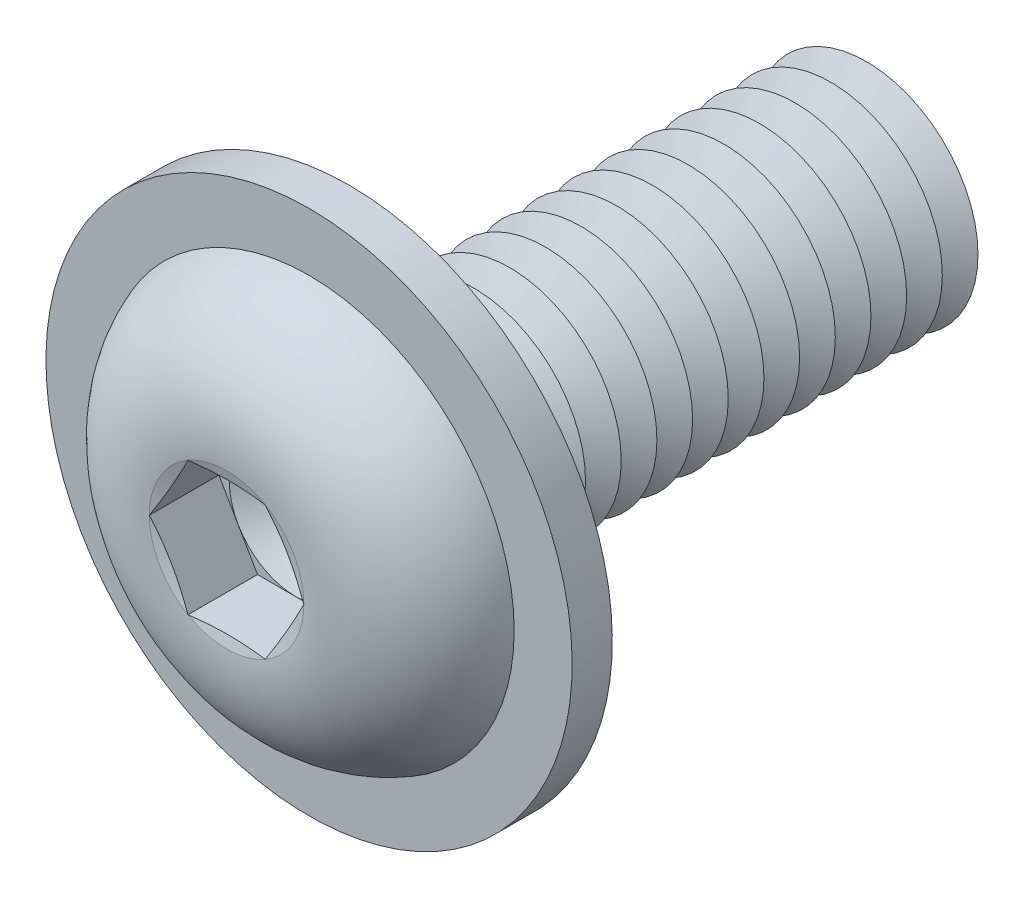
ISO-10303-21;
HEADER;
FILE_DESCRIPTION(('STEP AP214'),'2;1');
FILE_NAME('part.step','',(''),(''),'','','');
FILE_SCHEMA(('AUTOMOTIVE_DESIGN { 1 0 10303 214 1 1 1 1 }'));
ENDSEC;
DATA;
#1=APPLICATION_CONTEXT('core data for automotive mechanical design processes');
#2=APPLICATION_PROTOCOL_DEFINITION('international standard','automotive_design',2000,#1);
#3=PRODUCT_CONTEXT('',#1,'mechanical');
#4=PRODUCT('Part','Part','',(#3));
#5=PRODUCT_RELATED_PRODUCT_CATEGORY('part','',(#4));
#6=PRODUCT_DEFINITION_FORMATION('','',#4);
#7=PRODUCT_DEFINITION_CONTEXT('part definition',#1,'design');
#8=PRODUCT_DEFINITION('design','',#6,#7);
#9=PRODUCT_DEFINITION_SHAPE('','',#8);
#10=(LENGTH_UNIT() NAMED_UNIT(*) SI_UNIT(.MILLI.,.METRE.));
#11=(NAMED_UNIT(*) PLANE_ANGLE_UNIT() SI_UNIT($,.RADIAN.));
#12=(NAMED_UNIT(*) SI_UNIT($,.STERADIAN.) SOLID_ANGLE_UNIT());
#13=UNCERTAINTY_MEASURE_WITH_UNIT(LENGTH_MEASURE(1.E-05),#10,'distance_accuracy_value','');
#14=(GEOMETRIC_REPRESENTATION_CONTEXT(3) GLOBAL_UNCERTAINTY_ASSIGNED_CONTEXT((#13)) GLOBAL_UNIT_ASSIGNED_CONTEXT((#10,
#11,#12)) REPRESENTATION_CONTEXT('',''));
#15=CARTESIAN_POINT('',(0.,0.,0.));
#16=DIRECTION('',(0.,0.,1.));
#17=DIRECTION('',(1.,0.,0.));
#18=AXIS2_PLACEMENT_3D('',#15,#16,#17);
#19=CARTESIAN_POINT('',(0.,0.,-9.2));
#20=DIRECTION('',(0.,0.,1.));
#21=DIRECTION('',(1.,0.,0.));
#22=AXIS2_PLACEMENT_3D('',#19,#20,#21);
#23=CONICAL_SURFACE('',#22,2.50000000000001,1.0471975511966);
#24=CARTESIAN_POINT('',(0.,0.,-9.6));
#25=DIRECTION('',(0.,0.,1.));
#26=DIRECTION('',(1.,0.,0.));
#27=AXIS2_PLACEMENT_3D('',#24,#25,#26);
#28=CIRCLE('',#27,1.80717967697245);
#29=CARTESIAN_POINT('',(1.80717967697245,0.,-9.6));
#30=VERTEX_POINT('',#29);
#31=EDGE_CURVE('E330',#30,#30,#28,.T.);
#32=ORIENTED_EDGE('',*,*,#31,.T.);
#33=EDGE_LOOP('',(#32));
#34=FACE_BOUND('',#33,.T.);
#35=CARTESIAN_POINT('',(0.,0.,-9.2));
#36=DIRECTION('',(0.,0.,1.));
#37=DIRECTION('',(1.,0.,0.));
#38=AXIS2_PLACEMENT_3D('',#35,#36,#37);
#39=CIRCLE('',#38,2.50000000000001);
#40=CARTESIAN_POINT('',(2.50000000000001,0.,-9.2));
#41=VERTEX_POINT('',#40);
#42=EDGE_CURVE('E326',#41,#41,#39,.T.);
#43=ORIENTED_EDGE('',*,*,#42,.F.);
#44=EDGE_LOOP('',(#43));
#45=FACE_BOUND('',#44,.T.);
#46=ADVANCED_FACE('F39',(#34,#45),#23,.T.);
#47=CARTESIAN_POINT('',(0.,0.,-9.6));
#48=DIRECTION('',(0.,0.,-1.));
#49=DIRECTION('',(-1.,0.,0.));
#50=AXIS2_PLACEMENT_3D('',#47,#48,#49);
#51=CONICAL_SURFACE('',#50,1.80717967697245,1.0471975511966);
#52=CARTESIAN_POINT('',(0.,0.,-10.));
#53=DIRECTION('',(0.,0.,1.));
#54=DIRECTION('',(1.,0.,0.));
#55=AXIS2_PLACEMENT_3D('',#52,#53,#54);
#56=CIRCLE('',#55,2.50000000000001);
#57=CARTESIAN_POINT('',(2.50000000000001,0.,-10.));
#58=VERTEX_POINT('',#57);
#59=EDGE_CURVE('E334',#58,#58,#56,.T.);
#60=ORIENTED_EDGE('',*,*,#59,.T.);
#61=EDGE_LOOP('',(#60));
#62=FACE_BOUND('',#61,.T.);
#63=ORIENTED_EDGE('',*,*,#31,.F.);
#64=EDGE_LOOP('',(#63));
#65=FACE_BOUND('',#64,.T.);
#66=ADVANCED_FACE('F463',(#62,#65),#51,.T.);
#67=CARTESIAN_POINT('',(0.,2.50000000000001,-12.));
#68=DIRECTION('',(0.,0.,-1.));
#69=DIRECTION('',(-1.,0.,0.));
#70=AXIS2_PLACEMENT_3D('',#67,#68,#69);
#71=PLANE('',#70);
#72=CARTESIAN_POINT('',(0.,0.,-12.));
#73=DIRECTION('',(0.,0.,1.));
#74=DIRECTION('',(1.,0.,0.));
#75=AXIS2_PLACEMENT_3D('',#72,#73,#74);
#76=CIRCLE('',#75,1.80717967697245);
#77=CARTESIAN_POINT('',(1.80717967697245,0.,-12.));
#78=VERTEX_POINT('',#77);
#79=EDGE_CURVE('E354',#78,#78,#76,.T.);
#80=ORIENTED_EDGE('',*,*,#79,.F.);
#81=EDGE_LOOP('',(#80));
#82=FACE_BOUND('',#81,.T.);
#83=ADVANCED_FACE('F469',(#82),#71,.T.);
#84=CARTESIAN_POINT('',(0.,0.,-11.6));
#85=DIRECTION('',(0.,0.,1.));
#86=DIRECTION('',(1.,0.,0.));
#87=AXIS2_PLACEMENT_3D('',#84,#85,#86);
#88=CONICAL_SURFACE('',#87,2.50000000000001,1.0471975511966);
#89=ORIENTED_EDGE('',*,*,#79,.T.);
#90=EDGE_LOOP('',(#89));
#91=FACE_BOUND('',#90,.T.);
#92=CARTESIAN_POINT('',(0.,0.,-11.6));
#93=DIRECTION('',(0.,0.,1.));
#94=DIRECTION('',(1.,0.,0.));
#95=AXIS2_PLACEMENT_3D('',#92,#93,#94);
#96=CIRCLE('',#95,2.50000000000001);
#97=CARTESIAN_POINT('',(2.50000000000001,0.,-11.6));
#98=VERTEX_POINT('',#97);
#99=EDGE_CURVE('E350',#98,#98,#96,.T.);
#100=ORIENTED_EDGE('',*,*,#99,.F.);
#101=EDGE_LOOP('',(#100));
#102=FACE_BOUND('',#101,.T.);
#103=ADVANCED_FACE('F488',(#91,#102),#88,.T.);
#104=CARTESIAN_POINT('',(0.,0.,-11.2));
#105=DIRECTION('',(0.,0.,-1.));
#106=DIRECTION('',(-1.,0.,0.));
#107=AXIS2_PLACEMENT_3D('',#104,#105,#106);
#108=CONICAL_SURFACE('',#107,1.80717967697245,1.0471975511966);
#109=ORIENTED_EDGE('',*,*,#99,.T.);
#110=EDGE_LOOP('',(#109));
#111=FACE_BOUND('',#110,.T.);
#112=CARTESIAN_POINT('',(0.,0.,-11.2));
#113=DIRECTION('',(0.,0.,1.));
#114=DIRECTION('',(1.,0.,0.));
#115=AXIS2_PLACEMENT_3D('',#112,#113,#114);
#116=CIRCLE('',#115,1.80717967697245);
#117=CARTESIAN_POINT('',(1.80717967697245,0.,-11.2));
#118=VERTEX_POINT('',#117);
#119=EDGE_CURVE('E346',#118,#118,#116,.T.);
#120=ORIENTED_EDGE('',*,*,#119,.F.);
#121=EDGE_LOOP('',(#120));
#122=FACE_BOUND('',#121,.T.);
#123=ADVANCED_FACE('F485',(#111,#122),#108,.T.);
#124=CARTESIAN_POINT('',(0.,0.,-10.8));
#125=DIRECTION('',(0.,0.,1.));
#126=DIRECTION('',(1.,0.,0.));
#127=AXIS2_PLACEMENT_3D('',#124,#125,#126);
#128=CONICAL_SURFACE('',#127,2.50000000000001,1.0471975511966);
#129=ORIENTED_EDGE('',*,*,#119,.T.);
#130=EDGE_LOOP('',(#129));
#131=FACE_BOUND('',#130,.T.);
#132=CARTESIAN_POINT('',(0.,0.,-10.8));
#133=DIRECTION('',(0.,0.,1.));
#134=DIRECTION('',(1.,0.,0.));
#135=AXIS2_PLACEMENT_3D('',#132,#133,#134);
#136=CIRCLE('',#135,2.50000000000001);
#137=CARTESIAN_POINT('',(2.50000000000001,0.,-10.8));
#138=VERTEX_POINT('',#137);
#139=EDGE_CURVE('E342',#138,#138,#136,.T.);
#140=ORIENTED_EDGE('',*,*,#139,.F.);
#141=EDGE_LOOP('',(#140));
#142=FACE_BOUND('',#141,.T.);
#143=ADVANCED_FACE('F479',(#131,#142),#128,.T.);
#144=CARTESIAN_POINT('',(0.,0.,-10.4));
#145=DIRECTION('',(0.,0.,-1.));
#146=DIRECTION('',(-1.,0.,0.));
#147=AXIS2_PLACEMENT_3D('',#144,#145,#146);
#148=CONICAL_SURFACE('',#147,1.80717967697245,1.0471975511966);
#149=ORIENTED_EDGE('',*,*,#139,.T.);
#150=EDGE_LOOP('',(#149));
#151=FACE_BOUND('',#150,.T.);
#152=CARTESIAN_POINT('',(0.,0.,-10.4));
#153=DIRECTION('',(0.,0.,1.));
#154=DIRECTION('',(1.,0.,0.));
#155=AXIS2_PLACEMENT_3D('',#152,#153,#154);
#156=CIRCLE('',#155,1.80717967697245);
#157=CARTESIAN_POINT('',(1.80717967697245,0.,-10.4));
#158=VERTEX_POINT('',#157);
#159=EDGE_CURVE('E338',#158,#158,#156,.T.);
#160=ORIENTED_EDGE('',*,*,#159,.F.);
#161=EDGE_LOOP('',(#160));
#162=FACE_BOUND('',#161,.T.);
#163=ADVANCED_FACE('F475',(#151,#162),#148,.T.);
#164=CARTESIAN_POINT('',(0.,0.,-10.));
#165=DIRECTION('',(0.,0.,1.));
#166=DIRECTION('',(1.,0.,0.));
#167=AXIS2_PLACEMENT_3D('',#164,#165,#166);
#168=CONICAL_SURFACE('',#167,2.50000000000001,1.0471975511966);
#169=ORIENTED_EDGE('',*,*,#159,.T.);
#170=EDGE_LOOP('',(#169));
#171=FACE_BOUND('',#170,.T.);
#172=ORIENTED_EDGE('',*,*,#59,.F.);
#173=EDGE_LOOP('',(#172));
#174=FACE_BOUND('',#173,.T.);
#175=ADVANCED_FACE('F478',(#171,#174),#168,.T.);
#176=CARTESIAN_POINT('',(0.,0.,-8.4));
#177=DIRECTION('',(0.,0.,1.));
#178=DIRECTION('',(1.,0.,0.));
#179=AXIS2_PLACEMENT_3D('',#176,#177,#178);
#180=CONICAL_SURFACE('',#179,2.50000000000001,1.0471975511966);
#181=CARTESIAN_POINT('',(0.,0.,-8.8));
#182=DIRECTION('',(0.,0.,1.));
#183=DIRECTION('',(1.,0.,0.));
#184=AXIS2_PLACEMENT_3D('',#181,#182,#183);
#185=CIRCLE('',#184,1.80717967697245);
#186=CARTESIAN_POINT('',(1.80717967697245,0.,-8.8));
#187=VERTEX_POINT('',#186);
#188=EDGE_CURVE('E322',#187,#187,#185,.T.);
#189=ORIENTED_EDGE('',*,*,#188,.T.);
#190=EDGE_LOOP('',(#189));
#191=FACE_BOUND('',#190,.T.);
#192=CARTESIAN_POINT('',(0.,0.,-8.4));
#193=DIRECTION('',(0.,0.,1.));
#194=DIRECTION('',(1.,0.,0.));
#195=AXIS2_PLACEMENT_3D('',#192,#193,#194);
#196=CIRCLE('',#195,2.50000000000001);
#197=CARTESIAN_POINT('',(2.50000000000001,0.,-8.4));
#198=VERTEX_POINT('',#197);
#199=EDGE_CURVE('E318',#198,#198,#196,.T.);
#200=ORIENTED_EDGE('',*,*,#199,.F.);
#201=EDGE_LOOP('',(#200));
#202=FACE_BOUND('',#201,.T.);
#203=ADVANCED_FACE('F483',(#191,#202),#180,.T.);
#204=CARTESIAN_POINT('',(0.,0.,-8.8));
#205=DIRECTION('',(0.,0.,-1.));
#206=DIRECTION('',(-1.,0.,0.));
#207=AXIS2_PLACEMENT_3D('',#204,#205,#206);
#208=CONICAL_SURFACE('',#207,1.80717967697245,1.0471975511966);
#209=ORIENTED_EDGE('',*,*,#42,.T.);
#210=EDGE_LOOP('',(#209));
#211=FACE_BOUND('',#210,.T.);
#212=ORIENTED_EDGE('',*,*,#188,.F.);
#213=EDGE_LOOP('',(#212));
#214=FACE_BOUND('',#213,.T.);
#215=ADVANCED_FACE('F534',(#211,#214),#208,.T.);
#216=CARTESIAN_POINT('',(0.,0.,-7.6));
#217=DIRECTION('',(0.,0.,1.));
#218=DIRECTION('',(1.,0.,0.));
#219=AXIS2_PLACEMENT_3D('',#216,#217,#218);
#220=CONICAL_SURFACE('',#219,2.50000000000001,1.0471975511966);
#221=CARTESIAN_POINT('',(0.,0.,-8.));
#222=DIRECTION('',(0.,0.,1.));
#223=DIRECTION('',(1.,0.,0.));
#224=AXIS2_PLACEMENT_3D('',#221,#222,#223);
#225=CIRCLE('',#224,1.80717967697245);
#226=CARTESIAN_POINT('',(1.80717967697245,0.,-8.));
#227=VERTEX_POINT('',#226);
#228=EDGE_CURVE('E314',#227,#227,#225,.T.);
#229=ORIENTED_EDGE('',*,*,#228,.T.);
#230=EDGE_LOOP('',(#229));
#231=FACE_BOUND('',#230,.T.);
#232=CARTESIAN_POINT('',(0.,0.,-7.6));
#233=DIRECTION('',(0.,0.,1.));
#234=DIRECTION('',(1.,0.,0.));
#235=AXIS2_PLACEMENT_3D('',#232,#233,#234);
#236=CIRCLE('',#235,2.50000000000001);
#237=CARTESIAN_POINT('',(2.50000000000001,0.,-7.6));
#238=VERTEX_POINT('',#237);
#239=EDGE_CURVE('E310',#238,#238,#236,.T.);
#240=ORIENTED_EDGE('',*,*,#239,.F.);
#241=EDGE_LOOP('',(#240));
#242=FACE_BOUND('',#241,.T.);
#243=ADVANCED_FACE('F540',(#231,#242),#220,.T.);
#244=CARTESIAN_POINT('',(0.,0.,-8.));
#245=DIRECTION('',(0.,0.,-1.));
#246=DIRECTION('',(-1.,0.,0.));
#247=AXIS2_PLACEMENT_3D('',#244,#245,#246);
#248=CONICAL_SURFACE('',#247,1.80717967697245,1.0471975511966);
#249=ORIENTED_EDGE('',*,*,#199,.T.);
#250=EDGE_LOOP('',(#249));
#251=FACE_BOUND('',#250,.T.);
#252=ORIENTED_EDGE('',*,*,#228,.F.);
#253=EDGE_LOOP('',(#252));
#254=FACE_BOUND('',#253,.T.);
#255=ADVANCED_FACE('F547',(#251,#254),#248,.T.);
#256=CARTESIAN_POINT('',(0.,0.,-6.8));
#257=DIRECTION('',(0.,0.,1.));
#258=DIRECTION('',(1.,0.,0.));
#259=AXIS2_PLACEMENT_3D('',#256,#257,#258);
#260=CONICAL_SURFACE('',#259,2.50000000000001,1.0471975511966);
#261=CARTESIAN_POINT('',(0.,0.,-7.2));
#262=DIRECTION('',(0.,0.,1.));
#263=DIRECTION('',(1.,0.,0.));
#264=AXIS2_PLACEMENT_3D('',#261,#262,#263);
#265=CIRCLE('',#264,1.80717967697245);
#266=CARTESIAN_POINT('',(1.80717967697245,0.,-7.2));
#267=VERTEX_POINT('',#266);
#268=EDGE_CURVE('E306',#267,#267,#265,.T.);
#269=ORIENTED_EDGE('',*,*,#268,.T.);
#270=EDGE_LOOP('',(#269));
#271=FACE_BOUND('',#270,.T.);
#272=CARTESIAN_POINT('',(0.,0.,-6.8));
#273=DIRECTION('',(0.,0.,1.));
#274=DIRECTION('',(1.,0.,0.));
#275=AXIS2_PLACEMENT_3D('',#272,#273,#274);
#276=CIRCLE('',#275,2.50000000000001);
#277=CARTESIAN_POINT('',(2.50000000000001,0.,-6.8));
#278=VERTEX_POINT('',#277);
#279=EDGE_CURVE('E302',#278,#278,#276,.T.);
#280=ORIENTED_EDGE('',*,*,#279,.F.);
#281=EDGE_LOOP('',(#280));
#282=FACE_BOUND('',#281,.T.);
#283=ADVANCED_FACE('F554',(#271,#282),#260,.T.);
#284=CARTESIAN_POINT('',(0.,0.,-7.2));
#285=DIRECTION('',(0.,0.,-1.));
#286=DIRECTION('',(-1.,0.,0.));
#287=AXIS2_PLACEMENT_3D('',#284,#285,#286);
#288=CONICAL_SURFACE('',#287,1.80717967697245,1.0471975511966);
#289=ORIENTED_EDGE('',*,*,#239,.T.);
#290=EDGE_LOOP('',(#289));
#291=FACE_BOUND('',#290,.T.);
#292=ORIENTED_EDGE('',*,*,#268,.F.);
#293=EDGE_LOOP('',(#292));
#294=FACE_BOUND('',#293,.T.);
#295=ADVANCED_FACE('F561',(#291,#294),#288,.T.);
#296=CARTESIAN_POINT('',(0.,0.,-6.));
#297=DIRECTION('',(0.,0.,1.));
#298=DIRECTION('',(1.,0.,0.));
#299=AXIS2_PLACEMENT_3D('',#296,#297,#298);
#300=CONICAL_SURFACE('',#299,2.50000000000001,1.0471975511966);
#301=CARTESIAN_POINT('',(0.,0.,-6.4));
#302=DIRECTION('',(0.,0.,1.));
#303=DIRECTION('',(1.,0.,0.));
#304=AXIS2_PLACEMENT_3D('',#301,#302,#303);
#305=CIRCLE('',#304,1.80717967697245);
#306=CARTESIAN_POINT('',(1.80717967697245,0.,-6.4));
#307=VERTEX_POINT('',#306);
#308=EDGE_CURVE('E298',#307,#307,#305,.T.);
#309=ORIENTED_EDGE('',*,*,#308,.T.);
#310=EDGE_LOOP('',(#309));
#311=FACE_BOUND('',#310,.T.);
#312=CARTESIAN_POINT('',(0.,0.,-6.));
#313=DIRECTION('',(0.,0.,1.));
#314=DIRECTION('',(1.,0.,0.));
#315=AXIS2_PLACEMENT_3D('',#312,#313,#314);
#316=CIRCLE('',#315,2.50000000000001);
#317=CARTESIAN_POINT('',(2.50000000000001,0.,-6.));
#318=VERTEX_POINT('',#317);
#319=EDGE_CURVE('E294',#318,#318,#316,.T.);
#320=ORIENTED_EDGE('',*,*,#319,.F.);
#321=EDGE_LOOP('',(#320));
#322=FACE_BOUND('',#321,.T.);
#323=ADVANCED_FACE('F568',(#311,#322),#300,.T.);
#324=CARTESIAN_POINT('',(0.,0.,-6.4));
#325=DIRECTION('',(0.,0.,-1.));
#326=DIRECTION('',(-1.,0.,0.));
#327=AXIS2_PLACEMENT_3D('',#324,#325,#326);
#328=CONICAL_SURFACE('',#327,1.80717967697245,1.0471975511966);
#329=ORIENTED_EDGE('',*,*,#279,.T.);
#330=EDGE_LOOP('',(#329));
#331=FACE_BOUND('',#330,.T.);
#332=ORIENTED_EDGE('',*,*,#308,.F.);
#333=EDGE_LOOP('',(#332));
#334=FACE_BOUND('',#333,.T.);
#335=ADVANCED_FACE('F575',(#331,#334),#328,.T.);
#336=CARTESIAN_POINT('',(0.,0.,-5.2));
#337=DIRECTION('',(0.,0.,1.));
#338=DIRECTION('',(1.,0.,0.));
#339=AXIS2_PLACEMENT_3D('',#336,#337,#338);
#340=CONICAL_SURFACE('',#339,2.50000000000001,1.0471975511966);
#341=CARTESIAN_POINT('',(0.,0.,-5.6));
#342=DIRECTION('',(0.,0.,1.));
#343=DIRECTION('',(1.,0.,0.));
#344=AXIS2_PLACEMENT_3D('',#341,#342,#343);
#345=CIRCLE('',#344,1.80717967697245);
#346=CARTESIAN_POINT('',(1.80717967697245,0.,-5.6));
#347=VERTEX_POINT('',#346);
#348=EDGE_CURVE('E290',#347,#347,#345,.T.);
#349=ORIENTED_EDGE('',*,*,#348,.T.);
#350=EDGE_LOOP('',(#349));
#351=FACE_BOUND('',#350,.T.);
#352=CARTESIAN_POINT('',(0.,0.,-5.2));
#353=DIRECTION('',(0.,0.,1.));
#354=DIRECTION('',(1.,0.,0.));
#355=AXIS2_PLACEMENT_3D('',#352,#353,#354);
#356=CIRCLE('',#355,2.50000000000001);
#357=CARTESIAN_POINT('',(2.50000000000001,0.,-5.2));
#358=VERTEX_POINT('',#357);
#359=EDGE_CURVE('E286',#358,#358,#356,.T.);
#360=ORIENTED_EDGE('',*,*,#359,.F.);
#361=EDGE_LOOP('',(#360));
#362=FACE_BOUND('',#361,.T.);
#363=ADVANCED_FACE('F582',(#351,#362),#340,.T.);
#364=CARTESIAN_POINT('',(0.,0.,-5.6));
#365=DIRECTION('',(0.,0.,-1.));
#366=DIRECTION('',(-1.,0.,0.));
#367=AXIS2_PLACEMENT_3D('',#364,#365,#366);
#368=CONICAL_SURFACE('',#367,1.80717967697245,1.0471975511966);
#369=ORIENTED_EDGE('',*,*,#319,.T.);
#370=EDGE_LOOP('',(#369));
#371=FACE_BOUND('',#370,.T.);
#372=ORIENTED_EDGE('',*,*,#348,.F.);
#373=EDGE_LOOP('',(#372));
#374=FACE_BOUND('',#373,.T.);
#375=ADVANCED_FACE('F589',(#371,#374),#368,.T.);
#376=CARTESIAN_POINT('',(0.,0.,-4.4));
#377=DIRECTION('',(0.,0.,1.));
#378=DIRECTION('',(1.,0.,0.));
#379=AXIS2_PLACEMENT_3D('',#376,#377,#378);
#380=CONICAL_SURFACE('',#379,2.50000000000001,1.0471975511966);
#381=CARTESIAN_POINT('',(0.,0.,-4.8));
#382=DIRECTION('',(0.,0.,1.));
#383=DIRECTION('',(1.,0.,0.));
#384=AXIS2_PLACEMENT_3D('',#381,#382,#383);
#385=CIRCLE('',#384,1.80717967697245);
#386=CARTESIAN_POINT('',(1.80717967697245,0.,-4.8));
#387=VERTEX_POINT('',#386);
#388=EDGE_CURVE('E282',#387,#387,#385,.T.);
#389=ORIENTED_EDGE('',*,*,#388,.T.);
#390=EDGE_LOOP('',(#389));
#391=FACE_BOUND('',#390,.T.);
#392=CARTESIAN_POINT('',(0.,0.,-4.4));
#393=DIRECTION('',(0.,0.,1.));
#394=DIRECTION('',(1.,0.,0.));
#395=AXIS2_PLACEMENT_3D('',#392,#393,#394);
#396=CIRCLE('',#395,2.50000000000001);
#397=CARTESIAN_POINT('',(2.50000000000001,0.,-4.4));
#398=VERTEX_POINT('',#397);
#399=EDGE_CURVE('E278',#398,#398,#396,.T.);
#400=ORIENTED_EDGE('',*,*,#399,.F.);
#401=EDGE_LOOP('',(#400));
#402=FACE_BOUND('',#401,.T.);
#403=ADVANCED_FACE('F596',(#391,#402),#380,.T.);
#404=CARTESIAN_POINT('',(0.,0.,-4.8));
#405=DIRECTION('',(0.,0.,-1.));
#406=DIRECTION('',(-1.,0.,0.));
#407=AXIS2_PLACEMENT_3D('',#404,#405,#406);
#408=CONICAL_SURFACE('',#407,1.80717967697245,1.0471975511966);
#409=ORIENTED_EDGE('',*,*,#359,.T.);
#410=EDGE_LOOP('',(#409));
#411=FACE_BOUND('',#410,.T.);
#412=ORIENTED_EDGE('',*,*,#388,.F.);
#413=EDGE_LOOP('',(#412));
#414=FACE_BOUND('',#413,.T.);
#415=ADVANCED_FACE('F603',(#411,#414),#408,.T.);
#416=CARTESIAN_POINT('',(0.,0.,-3.6));
#417=DIRECTION('',(0.,0.,1.));
#418=DIRECTION('',(1.,0.,0.));
#419=AXIS2_PLACEMENT_3D('',#416,#417,#418);
#420=CONICAL_SURFACE('',#419,2.50000000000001,1.0471975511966);
#421=CARTESIAN_POINT('',(0.,0.,-4.));
#422=DIRECTION('',(0.,0.,1.));
#423=DIRECTION('',(1.,0.,0.));
#424=AXIS2_PLACEMENT_3D('',#421,#422,#423);
#425=CIRCLE('',#424,1.80717967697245);
#426=CARTESIAN_POINT('',(1.80717967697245,0.,-4.));
#427=VERTEX_POINT('',#426);
#428=EDGE_CURVE('E274',#427,#427,#425,.T.);
#429=ORIENTED_EDGE('',*,*,#428,.T.);
#430=EDGE_LOOP('',(#429));
#431=FACE_BOUND('',#430,.T.);
#432=CARTESIAN_POINT('',(0.,0.,-3.6));
#433=DIRECTION('',(0.,0.,1.));
#434=DIRECTION('',(1.,0.,0.));
#435=AXIS2_PLACEMENT_3D('',#432,#433,#434);
#436=CIRCLE('',#435,2.50000000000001);
#437=CARTESIAN_POINT('',(2.50000000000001,0.,-3.6));
#438=VERTEX_POINT('',#437);
#439=EDGE_CURVE('E270',#438,#438,#436,.T.);
#440=ORIENTED_EDGE('',*,*,#439,.F.);
#441=EDGE_LOOP('',(#440));
#442=FACE_BOUND('',#441,.T.);
#443=ADVANCED_FACE('F610',(#431,#442),#420,.T.);
#444=CARTESIAN_POINT('',(0.,0.,-4.));
#445=DIRECTION('',(0.,0.,-1.));
#446=DIRECTION('',(-1.,0.,0.));
#447=AXIS2_PLACEMENT_3D('',#444,#445,#446);
#448=CONICAL_SURFACE('',#447,1.80717967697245,1.0471975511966);
#449=ORIENTED_EDGE('',*,*,#399,.T.);
#450=EDGE_LOOP('',(#449));
#451=FACE_BOUND('',#450,.T.);
#452=ORIENTED_EDGE('',*,*,#428,.F.);
#453=EDGE_LOOP('',(#452));
#454=FACE_BOUND('',#453,.T.);
#455=ADVANCED_FACE('F617',(#451,#454),#448,.T.);
#456=CARTESIAN_POINT('',(0.,0.,-2.8));
#457=DIRECTION('',(0.,0.,1.));
#458=DIRECTION('',(1.,0.,0.));
#459=AXIS2_PLACEMENT_3D('',#456,#457,#458);
#460=CONICAL_SURFACE('',#459,2.50000000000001,1.0471975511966);
#461=CARTESIAN_POINT('',(0.,0.,-3.2));
#462=DIRECTION('',(0.,0.,1.));
#463=DIRECTION('',(1.,0.,0.));
#464=AXIS2_PLACEMENT_3D('',#461,#462,#463);
#465=CIRCLE('',#464,1.80717967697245);
#466=CARTESIAN_POINT('',(1.80717967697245,0.,-3.2));
#467=VERTEX_POINT('',#466);
#468=EDGE_CURVE('E266',#467,#467,#465,.T.);
#469=ORIENTED_EDGE('',*,*,#468,.T.);
#470=EDGE_LOOP('',(#469));
#471=FACE_BOUND('',#470,.T.);
#472=CARTESIAN_POINT('',(0.,0.,-2.8));
#473=DIRECTION('',(0.,0.,1.));
#474=DIRECTION('',(1.,0.,0.));
#475=AXIS2_PLACEMENT_3D('',#472,#473,#474);
#476=CIRCLE('',#475,2.50000000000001);
#477=CARTESIAN_POINT('',(2.50000000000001,0.,-2.8));
#478=VERTEX_POINT('',#477);
#479=EDGE_CURVE('E262',#478,#478,#476,.T.);
#480=ORIENTED_EDGE('',*,*,#479,.F.);
#481=EDGE_LOOP('',(#480));
#482=FACE_BOUND('',#481,.T.);
#483=ADVANCED_FACE('F624',(#471,#482),#460,.T.);
#484=CARTESIAN_POINT('',(0.,0.,-3.2));
#485=DIRECTION('',(0.,0.,-1.));
#486=DIRECTION('',(-1.,0.,0.));
#487=AXIS2_PLACEMENT_3D('',#484,#485,#486);
#488=CONICAL_SURFACE('',#487,1.80717967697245,1.0471975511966);
#489=ORIENTED_EDGE('',*,*,#439,.T.);
#490=EDGE_LOOP('',(#489));
#491=FACE_BOUND('',#490,.T.);
#492=ORIENTED_EDGE('',*,*,#468,.F.);
#493=EDGE_LOOP('',(#492));
#494=FACE_BOUND('',#493,.T.);
#495=ADVANCED_FACE('F631',(#491,#494),#488,.T.);
#496=CARTESIAN_POINT('',(0.,0.,-2.));
#497=DIRECTION('',(0.,0.,1.));
#498=DIRECTION('',(1.,0.,0.));
#499=AXIS2_PLACEMENT_3D('',#496,#497,#498);
#500=CONICAL_SURFACE('',#499,2.50000000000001,1.0471975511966);
#501=CARTESIAN_POINT('',(0.,0.,-2.4));
#502=DIRECTION('',(0.,0.,1.));
#503=DIRECTION('',(1.,0.,0.));
#504=AXIS2_PLACEMENT_3D('',#501,#502,#503);
#505=CIRCLE('',#504,1.80717967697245);
#506=CARTESIAN_POINT('',(1.80717967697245,0.,-2.4));
#507=VERTEX_POINT('',#506);
#508=EDGE_CURVE('E258',#507,#507,#505,.T.);
#509=ORIENTED_EDGE('',*,*,#508,.T.);
#510=EDGE_LOOP('',(#509));
#511=FACE_BOUND('',#510,.T.);
#512=CARTESIAN_POINT('',(0.,0.,-2.));
#513=DIRECTION('',(0.,0.,1.));
#514=DIRECTION('',(1.,0.,0.));
#515=AXIS2_PLACEMENT_3D('',#512,#513,#514);
#516=CIRCLE('',#515,2.50000000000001);
#517=CARTESIAN_POINT('',(2.50000000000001,0.,-2.));
#518=VERTEX_POINT('',#517);
#519=EDGE_CURVE('E254',#518,#518,#516,.T.);
#520=ORIENTED_EDGE('',*,*,#519,.F.);
#521=EDGE_LOOP('',(#520));
#522=FACE_BOUND('',#521,.T.);
#523=ADVANCED_FACE('F638',(#511,#522),#500,.T.);
#524=CARTESIAN_POINT('',(0.,0.,-2.4));
#525=DIRECTION('',(0.,0.,-1.));
#526=DIRECTION('',(-1.,0.,0.));
#527=AXIS2_PLACEMENT_3D('',#524,#525,#526);
#528=CONICAL_SURFACE('',#527,1.80717967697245,1.0471975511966);
#529=ORIENTED_EDGE('',*,*,#479,.T.);
#530=EDGE_LOOP('',(#529));
#531=FACE_BOUND('',#530,.T.);
#532=ORIENTED_EDGE('',*,*,#508,.F.);
#533=EDGE_LOOP('',(#532));
#534=FACE_BOUND('',#533,.T.);
#535=ADVANCED_FACE('F645',(#531,#534),#528,.T.);
#536=CARTESIAN_POINT('',(0.,0.,-1.2));
#537=DIRECTION('',(0.,0.,1.));
#538=DIRECTION('',(1.,0.,0.));
#539=AXIS2_PLACEMENT_3D('',#536,#537,#538);
#540=CONICAL_SURFACE('',#539,2.50000000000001,1.0471975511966);
#541=CARTESIAN_POINT('',(0.,0.,-1.6));
#542=DIRECTION('',(0.,0.,1.));
#543=DIRECTION('',(1.,0.,0.));
#544=AXIS2_PLACEMENT_3D('',#541,#542,#543);
#545=CIRCLE('',#544,1.80717967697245);
#546=CARTESIAN_POINT('',(1.80717967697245,0.,-1.6));
#547=VERTEX_POINT('',#546);
#548=EDGE_CURVE('E250',#547,#547,#545,.T.);
#549=ORIENTED_EDGE('',*,*,#548,.T.);
#550=EDGE_LOOP('',(#549));
#551=FACE_BOUND('',#550,.T.);
#552=CARTESIAN_POINT('',(0.,0.,-1.2));
#553=DIRECTION('',(0.,0.,1.));
#554=DIRECTION('',(1.,0.,0.));
#555=AXIS2_PLACEMENT_3D('',#552,#553,#554);
#556=CIRCLE('',#555,2.50000000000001);
#557=CARTESIAN_POINT('',(2.50000000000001,0.,-1.2));
#558=VERTEX_POINT('',#557);
#559=EDGE_CURVE('E242',#558,#558,#556,.T.);
#560=ORIENTED_EDGE('',*,*,#559,.F.);
#561=EDGE_LOOP('',(#560));
#562=FACE_BOUND('',#561,.T.);
#563=ADVANCED_FACE('F652',(#551,#562),#540,.T.);
#564=CARTESIAN_POINT('',(0.,0.,-1.6));
#565=DIRECTION('',(0.,0.,-1.));
#566=DIRECTION('',(-1.,0.,0.));
#567=AXIS2_PLACEMENT_3D('',#564,#565,#566);
#568=CONICAL_SURFACE('',#567,1.80717967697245,1.0471975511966);
#569=ORIENTED_EDGE('',*,*,#519,.T.);
#570=EDGE_LOOP('',(#569));
#571=FACE_BOUND('',#570,.T.);
#572=ORIENTED_EDGE('',*,*,#548,.F.);
#573=EDGE_LOOP('',(#572));
#574=FACE_BOUND('',#573,.T.);
#575=ADVANCED_FACE('F659',(#571,#574),#568,.T.);
#576=CARTESIAN_POINT('',(0.,0.,-0.399999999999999));
#577=DIRECTION('',(0.,0.,1.));
#578=DIRECTION('',(1.,0.,0.));
#579=AXIS2_PLACEMENT_3D('',#576,#577,#578);
#580=CONICAL_SURFACE('',#579,2.50000000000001,1.0471975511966);
#581=CARTESIAN_POINT('',(0.,0.,-0.8));
#582=DIRECTION('',(0.,0.,1.));
#583=DIRECTION('',(1.,0.,0.));
#584=AXIS2_PLACEMENT_3D('',#581,#582,#583);
#585=CIRCLE('',#584,1.80717967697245);
#586=CARTESIAN_POINT('',(1.80717967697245,0.,-0.8));
#587=VERTEX_POINT('',#586);
#588=EDGE_CURVE('E231',#587,#587,#585,.T.);
#589=ORIENTED_EDGE('',*,*,#588,.T.);
#590=EDGE_LOOP('',(#589));
#591=FACE_BOUND('',#590,.T.);
#592=CARTESIAN_POINT('',(0.,0.,-0.399999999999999));
#593=DIRECTION('',(0.,0.,1.));
#594=DIRECTION('',(1.,0.,0.));
#595=AXIS2_PLACEMENT_3D('',#592,#593,#594);
#596=CIRCLE('',#595,2.50000000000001);
#597=CARTESIAN_POINT('',(2.50000000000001,0.,-0.399999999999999));
#598=VERTEX_POINT('',#597);
#599=EDGE_CURVE('E246',#598,#598,#596,.T.);
#600=ORIENTED_EDGE('',*,*,#599,.F.);
#601=EDGE_LOOP('',(#600));
#602=FACE_BOUND('',#601,.T.);
#603=ADVANCED_FACE('F666',(#591,#602),#580,.T.);
#604=CARTESIAN_POINT('',(0.,0.,-0.8));
#605=DIRECTION('',(0.,0.,-1.));
#606=DIRECTION('',(-1.,0.,0.));
#607=AXIS2_PLACEMENT_3D('',#604,#605,#606);
#608=CONICAL_SURFACE('',#607,1.80717967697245,1.0471975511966);
#609=ORIENTED_EDGE('',*,*,#559,.T.);
#610=EDGE_LOOP('',(#609));
#611=FACE_BOUND('',#610,.T.);
#612=ORIENTED_EDGE('',*,*,#588,.F.);
#613=EDGE_LOOP('',(#612));
#614=FACE_BOUND('',#613,.T.);
#615=ADVANCED_FACE('F220',(#611,#614),#608,.T.);
#616=CARTESIAN_POINT('',(0.,2.5,0.));
#617=DIRECTION('',(0.,0.,-1.));
#618=DIRECTION('',(-1.,0.,0.));
#619=AXIS2_PLACEMENT_3D('',#616,#617,#618);
#620=PLANE('',#619);
#621=CARTESIAN_POINT('',(0.,0.,0.));
#622=DIRECTION('',(0.,0.,-1.));
#623=DIRECTION('',(-1.,0.,0.));
#624=AXIS2_PLACEMENT_3D('',#621,#622,#623);
#625=CIRCLE('',#624,2.9);
#626=CARTESIAN_POINT('',(-2.9,0.,0.));
#627=VERTEX_POINT('',#626);
#628=EDGE_CURVE('E363',#627,#627,#625,.F.);
#629=ORIENTED_EDGE('',*,*,#628,.T.);
#630=EDGE_LOOP('',(#629));
#631=FACE_BOUND('',#630,.T.);
#632=CARTESIAN_POINT('',(0.,0.,0.));
#633=DIRECTION('',(0.,0.,-1.));
#634=DIRECTION('',(0.,1.,0.));
#635=AXIS2_PLACEMENT_3D('',#632,#633,#634);
#636=CIRCLE('',#635,5.9);
#637=CARTESIAN_POINT('',(0.,5.9,0.));
#638=VERTEX_POINT('',#637);
#639=EDGE_CURVE('E1001',#638,#638,#636,.T.);
#640=ORIENTED_EDGE('',*,*,#639,.T.);
#641=EDGE_LOOP('',(#640));
#642=FACE_BOUND('',#641,.T.);
#643=ADVANCED_FACE('F678',(#631,#642),#620,.T.);
#644=CARTESIAN_POINT('',(0.,0.,-0.399999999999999));
#645=DIRECTION('',(0.,0.,-1.));
#646=DIRECTION('',(-1.,0.,0.));
#647=AXIS2_PLACEMENT_3D('',#644,#645,#646);
#648=TOROIDAL_SURFACE('',#647,2.9,0.4);
#649=ORIENTED_EDGE('',*,*,#628,.F.);
#650=EDGE_LOOP('',(#649));
#651=FACE_BOUND('',#650,.T.);
#652=ORIENTED_EDGE('',*,*,#599,.T.);
#653=EDGE_LOOP('',(#652));
#654=FACE_BOUND('',#653,.T.);
#655=ADVANCED_FACE('F41',(#651,#654),#648,.F.);
#656=CARTESIAN_POINT('',(0.,0.,0.9));
#657=DIRECTION('',(0.,0.,-1.));
#658=DIRECTION('',(0.,1.,0.));
#659=AXIS2_PLACEMENT_3D('',#656,#657,#658);
#660=CYLINDRICAL_SURFACE('',#659,5.9);
#661=CARTESIAN_POINT('',(0.,0.,0.9));
#662=DIRECTION('',(0.,0.,-1.));
#663=DIRECTION('',(0.,1.,0.));
#664=AXIS2_PLACEMENT_3D('',#661,#662,#663);
#665=CIRCLE('',#664,5.9);
#666=CARTESIAN_POINT('',(0.,5.9,0.9));
#667=VERTEX_POINT('',#666);
#668=EDGE_CURVE('E1003',#667,#667,#665,.T.);
#669=ORIENTED_EDGE('',*,*,#668,.T.);
#670=EDGE_LOOP('',(#669));
#671=FACE_BOUND('',#670,.T.);
#672=ORIENTED_EDGE('',*,*,#639,.F.);
#673=EDGE_LOOP('',(#672));
#674=FACE_BOUND('',#673,.T.);
#675=ADVANCED_FACE('F689',(#671,#674),#660,.T.);
#676=CARTESIAN_POINT('',(0.,0.,0.9));
#677=DIRECTION('',(0.,0.,-1.));
#678=DIRECTION('',(0.,1.,0.));
#679=AXIS2_PLACEMENT_3D('',#676,#677,#678);
#680=PLANE('',#679);
#681=CARTESIAN_POINT('',(0.,0.,0.9));
#682=DIRECTION('',(0.,0.,-1.));
#683=DIRECTION('',(0.,1.,0.));
#684=AXIS2_PLACEMENT_3D('',#681,#682,#683);
#685=CIRCLE('',#684,4.59924727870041);
#686=CARTESIAN_POINT('',(0.,4.59924727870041,0.9));
#687=VERTEX_POINT('',#686);
#688=EDGE_CURVE('E43',#687,#687,#685,.F.);
#689=ORIENTED_EDGE('',*,*,#688,.F.);
#690=EDGE_LOOP('',(#689));
#691=FACE_BOUND('',#690,.T.);
#692=ORIENTED_EDGE('',*,*,#668,.F.);
#693=EDGE_LOOP('',(#692));
#694=FACE_BOUND('',#693,.T.);
#695=ADVANCED_FACE('F117',(#691,#694),#680,.F.);
#696=CARTESIAN_POINT('',(0.,0.,1.19));
#697=DIRECTION('',(0.,0.,1.));
#698=DIRECTION('',(1.,0.,0.));
#699=AXIS2_PLACEMENT_3D('',#696,#697,#698);
#700=CONICAL_SURFACE('',#699,1.49999930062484,1.0471975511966);
#701=CARTESIAN_POINT('',(0.,0.,0.323975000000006));
#702=VERTEX_POINT('',#701);
#703=VERTEX_LOOP('',#702);
#704=FACE_BOUND('',#703,.T.);
#705=CARTESIAN_POINT('',(0.,0.,1.19));
#706=DIRECTION('',(0.,0.,1.));
#707=DIRECTION('',(1.,0.,0.));
#708=AXIS2_PLACEMENT_3D('',#705,#706,#707);
#709=CIRCLE('',#708,1.49999930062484);
#710=CARTESIAN_POINT('',(1.2990375,0.749999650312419,1.19));
#711=VERTEX_POINT('',#710);
#712=CARTESIAN_POINT('',(0.,1.49999930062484,1.19));
#713=VERTEX_POINT('',#712);
#714=EDGE_CURVE('E120',#711,#713,#709,.T.);
#715=ORIENTED_EDGE('',*,*,#714,.T.);
#716=CARTESIAN_POINT('',(0.,0.,1.19));
#717=DIRECTION('',(0.,0.,1.));
#718=DIRECTION('',(1.,0.,0.));
#719=AXIS2_PLACEMENT_3D('',#716,#717,#718);
#720=CIRCLE('',#719,1.49999930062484);
#721=CARTESIAN_POINT('',(-1.2990375,0.749999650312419,1.19));
#722=VERTEX_POINT('',#721);
#723=EDGE_CURVE('E11',#713,#722,#720,.T.);
#724=ORIENTED_EDGE('',*,*,#723,.T.);
#725=CARTESIAN_POINT('',(-1.2990375,-0.749999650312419,1.19));
#726=VERTEX_POINT('',#725);
#727=EDGE_CURVE('E49',#722,#726,#720,.T.);
#728=ORIENTED_EDGE('',*,*,#727,.T.);
#729=CARTESIAN_POINT('',(0.,-1.49999930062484,1.19));
#730=VERTEX_POINT('',#729);
#731=EDGE_CURVE('E370',#726,#730,#720,.T.);
#732=ORIENTED_EDGE('',*,*,#731,.T.);
#733=CARTESIAN_POINT('',(1.2990375,-0.749999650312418,1.19));
#734=VERTEX_POINT('',#733);
#735=EDGE_CURVE('E57',#730,#734,#720,.T.);
#736=ORIENTED_EDGE('',*,*,#735,.T.);
#737=EDGE_CURVE('E50',#734,#711,#720,.T.);
#738=ORIENTED_EDGE('',*,*,#737,.T.);
#739=EDGE_LOOP('',(#715,#724,#728,#732,#736,#738));
#740=FACE_BOUND('',#739,.T.);
#741=ADVANCED_FACE('F114',(#704,#740),#700,.F.);
#742=CARTESIAN_POINT('',(0.,0.,1.19));
#743=DIRECTION('',(0.,0.,1.));
#744=DIRECTION('',(1.,0.,0.));
#745=AXIS2_PLACEMENT_3D('',#742,#743,#744);
#746=PLANE('',#745);
#747=ORIENTED_EDGE('',*,*,#731,.F.);
#748=DIRECTION('',(0.5,-0.866025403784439,0.));
#749=VECTOR('',#748,1.);
#750=CARTESIAN_POINT('',(-1.73205,0.,1.19));
#751=LINE('',#750,#749);
#752=CARTESIAN_POINT('',(-0.866025,-1.49999930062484,1.19));
#753=VERTEX_POINT('',#752);
#754=EDGE_CURVE('E154',#726,#753,#751,.T.);
#755=ORIENTED_EDGE('',*,*,#754,.T.);
#756=DIRECTION('',(1.,0.,0.));
#757=VECTOR('',#756,1.);
#758=CARTESIAN_POINT('',(-0.866025,-1.49999930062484,1.19));
#759=LINE('',#758,#757);
#760=EDGE_CURVE('E160',#753,#730,#759,.T.);
#761=ORIENTED_EDGE('',*,*,#760,.T.);
#762=EDGE_LOOP('',(#747,#755,#761));
#763=FACE_BOUND('',#762,.T.);
#764=ADVANCED_FACE('F116',(#763),#746,.T.);
#765=ORIENTED_EDGE('',*,*,#735,.F.);
#766=CARTESIAN_POINT('',(0.866024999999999,-1.49999930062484,1.19));
#767=VERTEX_POINT('',#766);
#768=EDGE_CURVE('E159',#730,#767,#759,.T.);
#769=ORIENTED_EDGE('',*,*,#768,.T.);
#770=DIRECTION('',(0.5,0.866025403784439,0.));
#771=VECTOR('',#770,1.);
#772=CARTESIAN_POINT('',(0.866024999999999,-1.49999930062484,1.19));
#773=LINE('',#772,#771);
#774=EDGE_CURVE('E165',#767,#734,#773,.T.);
#775=ORIENTED_EDGE('',*,*,#774,.T.);
#776=EDGE_LOOP('',(#765,#769,#775));
#777=FACE_BOUND('',#776,.T.);
#778=ADVANCED_FACE('F710',(#777),#746,.T.);
#779=ORIENTED_EDGE('',*,*,#737,.F.);
#780=CARTESIAN_POINT('',(1.73205,0.,1.19));
#781=VERTEX_POINT('',#780);
#782=EDGE_CURVE('E164',#734,#781,#773,.T.);
#783=ORIENTED_EDGE('',*,*,#782,.T.);
#784=DIRECTION('',(-0.5,0.866025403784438,0.));
#785=VECTOR('',#784,1.);
#786=CARTESIAN_POINT('',(1.73205,0.,1.19));
#787=LINE('',#786,#785);
#788=EDGE_CURVE('E142',#781,#711,#787,.T.);
#789=ORIENTED_EDGE('',*,*,#788,.T.);
#790=EDGE_LOOP('',(#779,#783,#789));
#791=FACE_BOUND('',#790,.T.);
#792=ADVANCED_FACE('F426',(#791),#746,.T.);
#793=ORIENTED_EDGE('',*,*,#714,.F.);
#794=CARTESIAN_POINT('',(0.866025,1.49999930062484,1.19));
#795=VERTEX_POINT('',#794);
#796=EDGE_CURVE('E127',#711,#795,#787,.T.);
#797=ORIENTED_EDGE('',*,*,#796,.T.);
#798=DIRECTION('',(-1.,0.,0.));
#799=VECTOR('',#798,1.);
#800=CARTESIAN_POINT('',(0.866025,1.49999930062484,1.19));
#801=LINE('',#800,#799);
#802=EDGE_CURVE('E138',#795,#713,#801,.T.);
#803=ORIENTED_EDGE('',*,*,#802,.T.);
#804=EDGE_LOOP('',(#793,#797,#803));
#805=FACE_BOUND('',#804,.T.);
#806=ADVANCED_FACE('F144',(#805),#746,.T.);
#807=ORIENTED_EDGE('',*,*,#723,.F.);
#808=CARTESIAN_POINT('',(-0.866025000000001,1.49999930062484,1.19));
#809=VERTEX_POINT('',#808);
#810=EDGE_CURVE('E133',#713,#809,#801,.T.);
#811=ORIENTED_EDGE('',*,*,#810,.T.);
#812=DIRECTION('',(-0.5,-0.866025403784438,0.));
#813=VECTOR('',#812,1.);
#814=CARTESIAN_POINT('',(-0.866025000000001,1.49999930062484,1.19));
#815=LINE('',#814,#813);
#816=EDGE_CURVE('E136',#809,#722,#815,.T.);
#817=ORIENTED_EDGE('',*,*,#816,.T.);
#818=EDGE_LOOP('',(#807,#811,#817));
#819=FACE_BOUND('',#818,.T.);
#820=ADVANCED_FACE('F132',(#819),#746,.T.);
#821=ORIENTED_EDGE('',*,*,#727,.F.);
#822=CARTESIAN_POINT('',(-1.73205,0.,1.19));
#823=VERTEX_POINT('',#822);
#824=EDGE_CURVE('E146',#722,#823,#815,.T.);
#825=ORIENTED_EDGE('',*,*,#824,.T.);
#826=EDGE_CURVE('E155',#823,#726,#751,.T.);
#827=ORIENTED_EDGE('',*,*,#826,.T.);
#828=EDGE_LOOP('',(#821,#825,#827));
#829=FACE_BOUND('',#828,.T.);
#830=ADVANCED_FACE('F385',(#829),#746,.T.);
#831=CARTESIAN_POINT('',(-1.73205,0.,1.19));
#832=DIRECTION('',(-0.866025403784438,-0.5,0.));
#833=DIRECTION('',(0.5,-0.866025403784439,0.));
#834=AXIS2_PLACEMENT_3D('',#831,#832,#833);
#835=PLANE('',#834);
#836=CARTESIAN_POINT('',(-1.73216547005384,0.000200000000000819,2.75003094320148));
#837=CARTESIAN_POINT('',(-1.69619207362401,-0.0621077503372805,2.74038633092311));
#838=CARTESIAN_POINT('',(-1.66015343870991,-0.124528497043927,2.73163050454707));
#839=CARTESIAN_POINT('',(-1.58794885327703,-0.249590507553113,2.71624720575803));
#840=CARTESIAN_POINT('',(-1.55178285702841,-0.312231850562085,2.70962059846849));
#841=CARTESIAN_POINT('',(-1.47954289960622,-0.437355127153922,2.69888271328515));
#842=CARTESIAN_POINT('',(-1.4434694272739,-0.499836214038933,2.69475862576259));
#843=CARTESIAN_POINT('',(-1.37127646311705,-0.624878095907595,2.68922863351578));
#844=CARTESIAN_POINT('',(-1.33515698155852,-0.687438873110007,2.68782220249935));
#845=CARTESIAN_POINT('',(-1.26291801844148,-0.812560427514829,2.68782220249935));
#846=CARTESIAN_POINT('',(-1.22679853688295,-0.87512120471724,2.68922863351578));
#847=CARTESIAN_POINT('',(-1.1546055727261,-1.0001630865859,2.69475862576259));
#848=CARTESIAN_POINT('',(-1.11853210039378,-1.06264417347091,2.69888271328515));
#849=CARTESIAN_POINT('',(-1.0462921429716,-1.18776745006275,2.70962059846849));
#850=CARTESIAN_POINT('',(-1.01012614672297,-1.25040879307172,2.71624720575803));
#851=CARTESIAN_POINT('',(-0.937921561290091,-1.37547080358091,2.73163050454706));
#852=CARTESIAN_POINT('',(-0.901882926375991,-1.43789155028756,2.74038633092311));
#853=CARTESIAN_POINT('',(-0.865909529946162,-1.50019930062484,2.75003094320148));
#854=B_SPLINE_CURVE_WITH_KNOTS('',3,(#836,#837,#838,#839,#840,#841,#842,#843,#844,#845,#846,
#847,#848,#849,#850,#851,#852,#853),.UNSPECIFIED.,.F.,.F.,(4,2,2,2,2,2,2,2,4),(0.,
0.217782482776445,0.435653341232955,0.652399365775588,0.869103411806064,1.08580745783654,
1.30255348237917,1.52042434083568,1.73820682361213),.UNSPECIFIED.);
#855=CARTESIAN_POINT('',(-1.73205,0.,2.75));
#856=VERTEX_POINT('',#855);
#857=CARTESIAN_POINT('',(-0.866025,-1.49999930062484,2.75));
#858=VERTEX_POINT('',#857);
#859=EDGE_CURVE('E390',#856,#858,#854,.T.);
#860=ORIENTED_EDGE('',*,*,#859,.T.);
#861=DIRECTION('',(0.,0.,1.));
#862=VECTOR('',#861,1.);
#863=CARTESIAN_POINT('',(-0.866025,-1.49999930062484,1.19));
#864=LINE('',#863,#862);
#865=EDGE_CURVE('E177',#753,#858,#864,.T.);
#866=ORIENTED_EDGE('',*,*,#865,.F.);
#867=ORIENTED_EDGE('',*,*,#754,.F.);
#868=ORIENTED_EDGE('',*,*,#826,.F.);
#869=DIRECTION('',(0.,0.,1.));
#870=VECTOR('',#869,1.);
#871=CARTESIAN_POINT('',(-1.73205,0.,1.19));
#872=LINE('',#871,#870);
#873=EDGE_CURVE('E181',#823,#856,#872,.T.);
#874=ORIENTED_EDGE('',*,*,#873,.T.);
#875=EDGE_LOOP('',(#860,#866,#867,#868,#874));
#876=FACE_BOUND('',#875,.T.);
#877=ADVANCED_FACE('F383',(#876),#835,.F.);
#878=CARTESIAN_POINT('',(-0.866025,-1.49999930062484,1.19));
#879=DIRECTION('',(0.,-1.,0.));
#880=DIRECTION('',(0.,0.,-1.));
#881=AXIS2_PLACEMENT_3D('',#878,#879,#880);
#882=PLANE('',#881);
#883=CARTESIAN_POINT('',(-2.61375031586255,-1.49999930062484,3.09338600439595));
#884=CARTESIAN_POINT('',(-2.48719895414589,-1.49999930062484,3.06401688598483));
#885=CARTESIAN_POINT('',(-2.36054180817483,-1.49999930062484,3.03507426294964));
#886=CARTESIAN_POINT('',(-2.10688190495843,-1.49999930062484,2.97862489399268));
#887=CARTESIAN_POINT('',(-1.97987908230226,-1.49999930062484,2.95111844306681));
#888=CARTESIAN_POINT('',(-1.72425281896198,-1.49999930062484,2.89788845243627));
#889=CARTESIAN_POINT('',(-1.59562534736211,-1.49999930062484,2.87218404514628));
#890=CARTESIAN_POINT('',(-1.33776732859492,-1.49999930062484,2.82387586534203));
#891=CARTESIAN_POINT('',(-1.20853672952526,-1.49999930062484,2.80127236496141));
#892=CARTESIAN_POINT('',(-0.952831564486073,-1.49999930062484,2.76126658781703));
#893=CARTESIAN_POINT('',(-0.826376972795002,-1.49999930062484,2.74374018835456));
#894=CARTESIAN_POINT('',(-0.572755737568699,-1.49999930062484,2.71502809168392));
#895=CARTESIAN_POINT('',(-0.445589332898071,-1.49999930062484,2.70384038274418));
#896=CARTESIAN_POINT('',(-0.191333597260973,-1.49999930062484,2.68972083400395));
#897=CARTESIAN_POINT('',(-0.0642464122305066,-1.49999930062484,2.68675270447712));
#898=CARTESIAN_POINT('',(0.189835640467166,-1.49999930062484,2.68959577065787));
#899=CARTESIAN_POINT('',(0.31683049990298,-1.49999930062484,2.69540767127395));
#900=CARTESIAN_POINT('',(0.53418249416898,-1.49999930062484,2.71190493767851));
#901=CARTESIAN_POINT('',(0.624691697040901,-1.49999930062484,2.72073513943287));
#902=CARTESIAN_POINT('',(0.80533656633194,-1.49999930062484,2.74156379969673));
#903=CARTESIAN_POINT('',(0.895472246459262,-1.49999930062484,2.75356214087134));
#904=CARTESIAN_POINT('',(1.0756572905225,-1.49999930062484,2.78006977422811));
#905=CARTESIAN_POINT('',(1.16570548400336,-1.49999930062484,2.7945868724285));
#906=CARTESIAN_POINT('',(1.3454787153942,-1.49999930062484,2.82550612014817));
#907=CARTESIAN_POINT('',(1.43520373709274,-1.49999930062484,2.8419083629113));
#908=CARTESIAN_POINT('',(1.61622412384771,-1.49999930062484,2.87648604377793));
#909=CARTESIAN_POINT('',(1.70751379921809,-1.49999930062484,2.89469103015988));
#910=CARTESIAN_POINT('',(1.88986344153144,-1.49999930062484,2.93221618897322));
#911=CARTESIAN_POINT('',(1.98092340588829,-1.49999930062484,2.95153637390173));
#912=CARTESIAN_POINT('',(2.16236354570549,-1.49999930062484,2.99091506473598));
#913=CARTESIAN_POINT('',(2.25274472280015,-1.49999930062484,3.01096897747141));
#914=CARTESIAN_POINT('',(2.43335289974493,-1.49999930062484,3.05173139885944));
#915=CARTESIAN_POINT('',(2.52357990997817,-1.49999930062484,3.07243986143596));
#916=CARTESIAN_POINT('',(2.61375031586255,-1.49999930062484,3.09338600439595));
#917=B_SPLINE_CURVE_WITH_KNOTS('',3,(#883,#884,#885,#886,#887,#888,#889,#890,#891,#892,#893,
#894,#895,#896,#897,#898,#899,#900,#901,#902,#903,#904,#905,#906,#907,#908,#909,#910,#911,#912,
#913,#914,#915,#916),.UNSPECIFIED.,.F.,.F.,(4,2,2,2,2,2,2,2,2,2,2,2,2,2,2,2,4),(0.,
0.389753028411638,0.779585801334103,1.17307326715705,1.5665952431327,1.94947555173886,
2.33223427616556,2.71330039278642,3.09439710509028,3.36715350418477,3.63989980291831,
3.91350699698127,4.18712773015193,4.4663802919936,4.74563598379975,5.02337106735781,
5.30108664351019),.UNSPECIFIED.);
#918=CARTESIAN_POINT('',(0.866024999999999,-1.49999930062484,2.75));
#919=VERTEX_POINT('',#918);
#920=EDGE_CURVE('E397',#858,#919,#917,.T.);
#921=ORIENTED_EDGE('',*,*,#920,.T.);
#922=DIRECTION('',(0.,0.,1.));
#923=VECTOR('',#922,1.);
#924=CARTESIAN_POINT('',(0.866024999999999,-1.49999930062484,1.19));
#925=LINE('',#924,#923);
#926=EDGE_CURVE('E173',#767,#919,#925,.T.);
#927=ORIENTED_EDGE('',*,*,#926,.F.);
#928=ORIENTED_EDGE('',*,*,#768,.F.);
#929=ORIENTED_EDGE('',*,*,#760,.F.);
#930=ORIENTED_EDGE('',*,*,#865,.T.);
#931=EDGE_LOOP('',(#921,#927,#928,#929,#930));
#932=FACE_BOUND('',#931,.T.);
#933=ADVANCED_FACE('F452',(#932),#882,.F.);
#934=CARTESIAN_POINT('',(0.866024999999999,-1.49999930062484,1.19));
#935=DIRECTION('',(0.866025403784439,-0.5,0.));
#936=DIRECTION('',(0.5,0.866025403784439,0.));
#937=AXIS2_PLACEMENT_3D('',#934,#935,#936);
#938=PLANE('',#937);
#939=CARTESIAN_POINT('',(0.865909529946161,-1.50019930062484,2.75003094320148));
#940=CARTESIAN_POINT('',(0.90188292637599,-1.43789155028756,2.74038633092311));
#941=CARTESIAN_POINT('',(0.93792156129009,-1.37547080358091,2.73163050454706));
#942=CARTESIAN_POINT('',(1.01012614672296,-1.25040879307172,2.71624720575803));
#943=CARTESIAN_POINT('',(1.04629214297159,-1.18776745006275,2.70962059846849));
#944=CARTESIAN_POINT('',(1.11853210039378,-1.06264417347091,2.69888271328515));
#945=CARTESIAN_POINT('',(1.1546055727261,-1.0001630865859,2.69475862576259));
#946=CARTESIAN_POINT('',(1.22679853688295,-0.87512120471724,2.68922863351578));
#947=CARTESIAN_POINT('',(1.26291801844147,-0.812560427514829,2.68782220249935));
#948=CARTESIAN_POINT('',(1.33515698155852,-0.687438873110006,2.68782220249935));
#949=CARTESIAN_POINT('',(1.37127646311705,-0.624878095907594,2.68922863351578));
#950=CARTESIAN_POINT('',(1.4434694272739,-0.499836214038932,2.69475862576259));
#951=CARTESIAN_POINT('',(1.47954289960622,-0.437355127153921,2.69888271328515));
#952=CARTESIAN_POINT('',(1.5517828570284,-0.312231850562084,2.70962059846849));
#953=CARTESIAN_POINT('',(1.58794885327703,-0.249590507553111,2.71624720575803));
#954=CARTESIAN_POINT('',(1.66015343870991,-0.124528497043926,2.73163050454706));
#955=CARTESIAN_POINT('',(1.69619207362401,-0.0621077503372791,2.74038633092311));
#956=CARTESIAN_POINT('',(1.73216547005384,0.000200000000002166,2.75003094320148));
#957=B_SPLINE_CURVE_WITH_KNOTS('',3,(#939,#940,#941,#942,#943,#944,#945,#946,#947,#948,#949,
#950,#951,#952,#953,#954,#955,#956),.UNSPECIFIED.,.F.,.F.,(4,2,2,2,2,2,2,2,4),(0.,
0.217782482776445,0.435653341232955,0.652399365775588,0.869103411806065,1.08580745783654,
1.30255348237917,1.52042434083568,1.73820682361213),.UNSPECIFIED.);
#958=CARTESIAN_POINT('',(1.73205,0.,2.75));
#959=VERTEX_POINT('',#958);
#960=EDGE_CURVE('E232',#919,#959,#957,.T.);
#961=ORIENTED_EDGE('',*,*,#960,.T.);
#962=DIRECTION('',(0.,0.,1.));
#963=VECTOR('',#962,1.);
#964=CARTESIAN_POINT('',(1.73205,0.,1.19));
#965=LINE('',#964,#963);
#966=EDGE_CURVE('E169',#781,#959,#965,.T.);
#967=ORIENTED_EDGE('',*,*,#966,.F.);
#968=ORIENTED_EDGE('',*,*,#782,.F.);
#969=ORIENTED_EDGE('',*,*,#774,.F.);
#970=ORIENTED_EDGE('',*,*,#926,.T.);
#971=EDGE_LOOP('',(#961,#967,#968,#969,#970));
#972=FACE_BOUND('',#971,.T.);
#973=ADVANCED_FACE('F218',(#972),#938,.F.);
#974=CARTESIAN_POINT('',(1.73205,0.,1.19));
#975=DIRECTION('',(0.866025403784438,0.5,0.));
#976=DIRECTION('',(-0.5,0.866025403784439,0.));
#977=AXIS2_PLACEMENT_3D('',#974,#975,#976);
#978=PLANE('',#977);
#979=CARTESIAN_POINT('',(1.73216547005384,-0.000199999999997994,2.75003094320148));
#980=CARTESIAN_POINT('',(1.69619207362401,0.0621077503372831,2.74038633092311));
#981=CARTESIAN_POINT('',(1.66015343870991,0.12452849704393,2.73163050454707));
#982=CARTESIAN_POINT('',(1.58794885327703,0.249590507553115,2.71624720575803));
#983=CARTESIAN_POINT('',(1.5517828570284,0.312231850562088,2.70962059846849));
#984=CARTESIAN_POINT('',(1.47954289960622,0.437355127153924,2.69888271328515));
#985=CARTESIAN_POINT('',(1.4434694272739,0.499836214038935,2.69475862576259));
#986=CARTESIAN_POINT('',(1.37127646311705,0.624878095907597,2.68922863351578));
#987=CARTESIAN_POINT('',(1.33515698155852,0.687438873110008,2.68782220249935));
#988=CARTESIAN_POINT('',(1.26291801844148,0.812560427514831,2.68782220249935));
#989=CARTESIAN_POINT('',(1.22679853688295,0.875121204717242,2.68922863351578));
#990=CARTESIAN_POINT('',(1.1546055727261,1.0001630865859,2.69475862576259));
#991=CARTESIAN_POINT('',(1.11853210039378,1.06264417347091,2.69888271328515));
#992=CARTESIAN_POINT('',(1.0462921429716,1.18776745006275,2.70962059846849));
#993=CARTESIAN_POINT('',(1.01012614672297,1.25040879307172,2.71624720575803));
#994=CARTESIAN_POINT('',(0.937921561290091,1.37547080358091,2.73163050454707));
#995=CARTESIAN_POINT('',(0.901882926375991,1.43789155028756,2.74038633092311));
#996=CARTESIAN_POINT('',(0.865909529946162,1.50019930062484,2.75003094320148));
#997=B_SPLINE_CURVE_WITH_KNOTS('',3,(#979,#980,#981,#982,#983,#984,#985,#986,#987,#988,#989,
#990,#991,#992,#993,#994,#995,#996),.UNSPECIFIED.,.F.,.F.,(4,2,2,2,2,2,2,2,4),(0.,
0.217782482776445,0.435653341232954,0.652399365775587,0.869103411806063,1.08580745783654,
1.30255348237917,1.52042434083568,1.73820682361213),.UNSPECIFIED.);
#998=CARTESIAN_POINT('',(0.866025,1.49999930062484,2.75));
#999=VERTEX_POINT('',#998);
#1000=EDGE_CURVE('E223',#959,#999,#997,.T.);
#1001=ORIENTED_EDGE('',*,*,#1000,.T.);
#1002=DIRECTION('',(0.,0.,1.));
#1003=VECTOR('',#1002,1.);
#1004=CARTESIAN_POINT('',(0.866025,1.49999930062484,1.19));
#1005=LINE('',#1004,#1003);
#1006=EDGE_CURVE('E65',#795,#999,#1005,.T.);
#1007=ORIENTED_EDGE('',*,*,#1006,.F.);
#1008=ORIENTED_EDGE('',*,*,#796,.F.);
#1009=ORIENTED_EDGE('',*,*,#788,.F.);
#1010=ORIENTED_EDGE('',*,*,#966,.T.);
#1011=EDGE_LOOP('',(#1001,#1007,#1008,#1009,#1010));
#1012=FACE_BOUND('',#1011,.T.);
#1013=ADVANCED_FACE('F212',(#1012),#978,.F.);
#1014=CARTESIAN_POINT('',(0.866025,1.49999930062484,1.19));
#1015=DIRECTION('',(0.,1.,0.));
#1016=DIRECTION('',(-1.,0.,0.));
#1017=AXIS2_PLACEMENT_3D('',#1014,#1015,#1016);
#1018=PLANE('',#1017);
#1019=CARTESIAN_POINT('',(2.61375031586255,1.49999930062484,3.09338600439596));
#1020=CARTESIAN_POINT('',(2.48719895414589,1.49999930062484,3.06401688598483));
#1021=CARTESIAN_POINT('',(2.36054180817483,1.49999930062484,3.03507426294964));
#1022=CARTESIAN_POINT('',(2.10688190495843,1.49999930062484,2.97862489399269));
#1023=CARTESIAN_POINT('',(1.97987908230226,1.49999930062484,2.95111844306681));
#1024=CARTESIAN_POINT('',(1.72425281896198,1.49999930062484,2.89788845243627));
#1025=CARTESIAN_POINT('',(1.59562534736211,1.49999930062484,2.87218404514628));
#1026=CARTESIAN_POINT('',(1.33776732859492,1.49999930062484,2.82387586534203));
#1027=CARTESIAN_POINT('',(1.20853672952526,1.49999930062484,2.80127236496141));
#1028=CARTESIAN_POINT('',(0.952831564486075,1.49999930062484,2.76126658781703));
#1029=CARTESIAN_POINT('',(0.826376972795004,1.49999930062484,2.74374018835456));
#1030=CARTESIAN_POINT('',(0.5727557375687,1.49999930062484,2.71502809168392));
#1031=CARTESIAN_POINT('',(0.445589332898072,1.49999930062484,2.70384038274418));
#1032=CARTESIAN_POINT('',(0.191333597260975,1.49999930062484,2.68972083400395));
#1033=CARTESIAN_POINT('',(0.0642464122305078,1.49999930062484,2.68675270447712));
#1034=CARTESIAN_POINT('',(-0.189835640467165,1.49999930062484,2.68959577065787));
#1035=CARTESIAN_POINT('',(-0.316830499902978,1.49999930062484,2.69540767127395));
#1036=CARTESIAN_POINT('',(-0.534182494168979,1.49999930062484,2.71190493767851));
#1037=CARTESIAN_POINT('',(-0.6246916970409,1.49999930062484,2.72073513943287));
#1038=CARTESIAN_POINT('',(-0.80533656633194,1.49999930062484,2.74156379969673));
#1039=CARTESIAN_POINT('',(-0.895472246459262,1.49999930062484,2.75356214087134));
#1040=CARTESIAN_POINT('',(-1.0756572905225,1.49999930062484,2.78006977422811));
#1041=CARTESIAN_POINT('',(-1.16570548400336,1.49999930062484,2.7945868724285));
#1042=CARTESIAN_POINT('',(-1.3454787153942,1.49999930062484,2.82550612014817));
#1043=CARTESIAN_POINT('',(-1.43520373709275,1.49999930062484,2.8419083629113));
#1044=CARTESIAN_POINT('',(-1.61622412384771,1.49999930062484,2.87648604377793));
#1045=CARTESIAN_POINT('',(-1.70751379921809,1.49999930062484,2.89469103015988));
#1046=CARTESIAN_POINT('',(-1.88986344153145,1.49999930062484,2.93221618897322));
#1047=CARTESIAN_POINT('',(-1.98092340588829,1.49999930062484,2.95153637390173));
#1048=CARTESIAN_POINT('',(-2.16236354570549,1.49999930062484,2.99091506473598));
#1049=CARTESIAN_POINT('',(-2.25274472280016,1.49999930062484,3.01096897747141));
#1050=CARTESIAN_POINT('',(-2.43335289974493,1.49999930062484,3.05173139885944));
#1051=CARTESIAN_POINT('',(-2.52357990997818,1.49999930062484,3.07243986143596));
#1052=CARTESIAN_POINT('',(-2.61375031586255,1.49999930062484,3.09338600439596));
#1053=B_SPLINE_CURVE_WITH_KNOTS('',3,(#1019,#1020,#1021,#1022,#1023,#1024,#1025,#1026,#1027,
#1028,#1029,#1030,#1031,#1032,#1033,#1034,#1035,#1036,#1037,#1038,#1039,#1040,#1041,#1042,#1043,
#1044,#1045,#1046,#1047,#1048,#1049,#1050,#1051,#1052),.UNSPECIFIED.,.F.,.F.,(4,2,2,2,2,2,2,2,2,
2,2,2,2,2,2,2,4),(0.,0.389753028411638,0.779585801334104,1.17307326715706,1.5665952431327,
1.94947555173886,2.33223427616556,2.71330039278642,3.09439710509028,3.36715350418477,
3.63989980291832,3.91350699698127,4.18712773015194,4.4663802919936,4.74563598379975,
5.02337106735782,5.3010866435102),.UNSPECIFIED.);
#1054=CARTESIAN_POINT('',(-0.866025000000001,1.49999930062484,2.75));
#1055=VERTEX_POINT('',#1054);
#1056=EDGE_CURVE('E172',#999,#1055,#1053,.T.);
#1057=ORIENTED_EDGE('',*,*,#1056,.T.);
#1058=DIRECTION('',(0.,0.,1.));
#1059=VECTOR('',#1058,1.);
#1060=CARTESIAN_POINT('',(-0.866025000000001,1.49999930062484,1.19));
#1061=LINE('',#1060,#1059);
#1062=EDGE_CURVE('E140',#809,#1055,#1061,.T.);
#1063=ORIENTED_EDGE('',*,*,#1062,.F.);
#1064=ORIENTED_EDGE('',*,*,#810,.F.);
#1065=ORIENTED_EDGE('',*,*,#802,.F.);
#1066=ORIENTED_EDGE('',*,*,#1006,.T.);
#1067=EDGE_LOOP('',(#1057,#1063,#1064,#1065,#1066));
#1068=FACE_BOUND('',#1067,.T.);
#1069=ADVANCED_FACE('F137',(#1068),#1018,.F.);
#1070=CARTESIAN_POINT('',(-0.866025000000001,1.49999930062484,1.19));
#1071=DIRECTION('',(-0.866025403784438,0.5,0.));
#1072=DIRECTION('',(-0.5,-0.866025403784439,0.));
#1073=AXIS2_PLACEMENT_3D('',#1070,#1071,#1072);
#1074=PLANE('',#1073);
#1075=CARTESIAN_POINT('',(-0.865909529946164,1.50019930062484,2.75003094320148));
#1076=CARTESIAN_POINT('',(-0.901882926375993,1.43789155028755,2.74038633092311));
#1077=CARTESIAN_POINT('',(-0.937921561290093,1.37547080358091,2.73163050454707));
#1078=CARTESIAN_POINT('',(-1.01012614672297,1.25040879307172,2.71624720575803));
#1079=CARTESIAN_POINT('',(-1.0462921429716,1.18776745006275,2.70962059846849));
#1080=CARTESIAN_POINT('',(-1.11853210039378,1.06264417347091,2.69888271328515));
#1081=CARTESIAN_POINT('',(-1.1546055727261,1.0001630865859,2.69475862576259));
#1082=CARTESIAN_POINT('',(-1.22679853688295,0.875121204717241,2.68922863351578));
#1083=CARTESIAN_POINT('',(-1.26291801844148,0.812560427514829,2.68782220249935));
#1084=CARTESIAN_POINT('',(-1.33515698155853,0.687438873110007,2.68782220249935));
#1085=CARTESIAN_POINT('',(-1.37127646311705,0.624878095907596,2.68922863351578));
#1086=CARTESIAN_POINT('',(-1.4434694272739,0.499836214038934,2.69475862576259));
#1087=CARTESIAN_POINT('',(-1.47954289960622,0.437355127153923,2.69888271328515));
#1088=CARTESIAN_POINT('',(-1.55178285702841,0.312231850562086,2.70962059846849));
#1089=CARTESIAN_POINT('',(-1.58794885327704,0.249590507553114,2.71624720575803));
#1090=CARTESIAN_POINT('',(-1.66015343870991,0.124528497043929,2.73163050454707));
#1091=CARTESIAN_POINT('',(-1.69619207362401,0.0621077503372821,2.74038633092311));
#1092=CARTESIAN_POINT('',(-1.73216547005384,-0.000199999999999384,2.75003094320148));
#1093=B_SPLINE_CURVE_WITH_KNOTS('',3,(#1075,#1076,#1077,#1078,#1079,#1080,#1081,#1082,#1083,
#1084,#1085,#1086,#1087,#1088,#1089,#1090,#1091,#1092),.UNSPECIFIED.,.F.,.F.,(4,2,2,2,2,2,2,2,
4),(0.,0.217782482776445,0.435653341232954,0.652399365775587,0.869103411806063,1.08580745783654,
1.30255348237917,1.52042434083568,1.73820682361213),.UNSPECIFIED.);
#1094=EDGE_CURVE('E197',#1055,#856,#1093,.T.);
#1095=ORIENTED_EDGE('',*,*,#1094,.T.);
#1096=ORIENTED_EDGE('',*,*,#873,.F.);
#1097=ORIENTED_EDGE('',*,*,#824,.F.);
#1098=ORIENTED_EDGE('',*,*,#816,.F.);
#1099=ORIENTED_EDGE('',*,*,#1062,.T.);
#1100=EDGE_LOOP('',(#1095,#1096,#1097,#1098,#1099));
#1101=FACE_BOUND('',#1100,.T.);
#1102=ADVANCED_FACE('F211',(#1101),#1074,.F.);
#1103=CARTESIAN_POINT('',(0.,0.,2.75));
#1104=DIRECTION('',(0.,0.,1.));
#1105=DIRECTION('',(1.,0.,0.));
#1106=AXIS2_PLACEMENT_3D('',#1103,#1104,#1105);
#1107=CONICAL_SURFACE('',#1106,1.73205,1.30899693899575);
#1108=ORIENTED_EDGE('',*,*,#859,.F.);
#1109=CARTESIAN_POINT('',(0.,0.,2.75));
#1110=DIRECTION('',(0.,0.,-1.));
#1111=DIRECTION('',(-1.,0.,0.));
#1112=AXIS2_PLACEMENT_3D('',#1109,#1110,#1111);
#1113=CIRCLE('',#1112,1.73205);
#1114=EDGE_CURVE('E358',#858,#856,#1113,.T.);
#1115=ORIENTED_EDGE('',*,*,#1114,.F.);
#1116=EDGE_LOOP('',(#1108,#1115));
#1117=FACE_BOUND('',#1116,.T.);
#1118=ADVANCED_FACE('F394',(#1117),#1107,.F.);
#1119=ORIENTED_EDGE('',*,*,#920,.F.);
#1120=EDGE_CURVE('E405',#919,#858,#1113,.T.);
#1121=ORIENTED_EDGE('',*,*,#1120,.F.);
#1122=EDGE_LOOP('',(#1119,#1121));
#1123=FACE_BOUND('',#1122,.T.);
#1124=ADVANCED_FACE('F439',(#1123),#1107,.F.);
#1125=ORIENTED_EDGE('',*,*,#960,.F.);
#1126=EDGE_CURVE('E418',#959,#919,#1113,.T.);
#1127=ORIENTED_EDGE('',*,*,#1126,.F.);
#1128=EDGE_LOOP('',(#1125,#1127));
#1129=FACE_BOUND('',#1128,.T.);
#1130=ADVANCED_FACE('F435',(#1129),#1107,.F.);
#1131=ORIENTED_EDGE('',*,*,#1000,.F.);
#1132=EDGE_CURVE('E416',#999,#959,#1113,.T.);
#1133=ORIENTED_EDGE('',*,*,#1132,.F.);
#1134=EDGE_LOOP('',(#1131,#1133));
#1135=FACE_BOUND('',#1134,.T.);
#1136=ADVANCED_FACE('F433',(#1135),#1107,.F.);
#1137=ORIENTED_EDGE('',*,*,#1056,.F.);
#1138=EDGE_CURVE('E364',#1055,#999,#1113,.T.);
#1139=ORIENTED_EDGE('',*,*,#1138,.F.);
#1140=EDGE_LOOP('',(#1137,#1139));
#1141=FACE_BOUND('',#1140,.T.);
#1142=ADVANCED_FACE('F204',(#1141),#1107,.F.);
#1143=ORIENTED_EDGE('',*,*,#1094,.F.);
#1144=EDGE_CURVE('E359',#856,#1055,#1113,.T.);
#1145=ORIENTED_EDGE('',*,*,#1144,.F.);
#1146=EDGE_LOOP('',(#1143,#1145));
#1147=FACE_BOUND('',#1146,.T.);
#1148=ADVANCED_FACE('F408',(#1147),#1107,.F.);
#1149=CARTESIAN_POINT('',(0.,0.,0.));
#1150=DIRECTION('',(0.,0.,-1.));
#1151=DIRECTION('',(-1.,0.,0.));
#1152=AXIS2_PLACEMENT_3D('',#1149,#1150,#1151);
#1153=DEGENERATE_TOROIDAL_SURFACE('',#1152,1.98810497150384,2.76189502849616,.T.);
#1154=ORIENTED_EDGE('',*,*,#1144,.T.);
#1155=ORIENTED_EDGE('',*,*,#1138,.T.);
#1156=ORIENTED_EDGE('',*,*,#1132,.T.);
#1157=ORIENTED_EDGE('',*,*,#1126,.T.);
#1158=ORIENTED_EDGE('',*,*,#1120,.T.);
#1159=ORIENTED_EDGE('',*,*,#1114,.T.);
#1160=EDGE_LOOP('',(#1154,#1155,#1156,#1157,#1158,#1159));
#1161=FACE_BOUND('',#1160,.T.);
#1162=ORIENTED_EDGE('',*,*,#688,.T.);
#1163=EDGE_LOOP('',(#1162));
#1164=FACE_BOUND('',#1163,.T.);
#1165=ADVANCED_FACE('F400',(#1161,#1164),#1153,.T.);
#1166=CLOSED_SHELL('',(#46,#66,#83,#103,#123,#143,#163,#175,#203,#215,#243,#255,#283,#295,#323,
#335,#363,#375,#403,#415,#443,#455,#483,#495,#523,#535,#563,#575,#603,#615,#643,#655,#675,#695,
#741,#764,#778,#792,#806,#820,#830,#877,#933,#973,#1013,#1069,#1102,#1118,#1124,#1130,#1136,
#1142,#1148,#1165));
#1167=MANIFOLD_SOLID_BREP('B2',#1166);
#1168=ADVANCED_BREP_SHAPE_REPRESENTATION('',(#18,#1167),#14);
#1169=SHAPE_DEFINITION_REPRESENTATION(#9,#1168);
ENDSEC;
END-ISO-10303-21;
